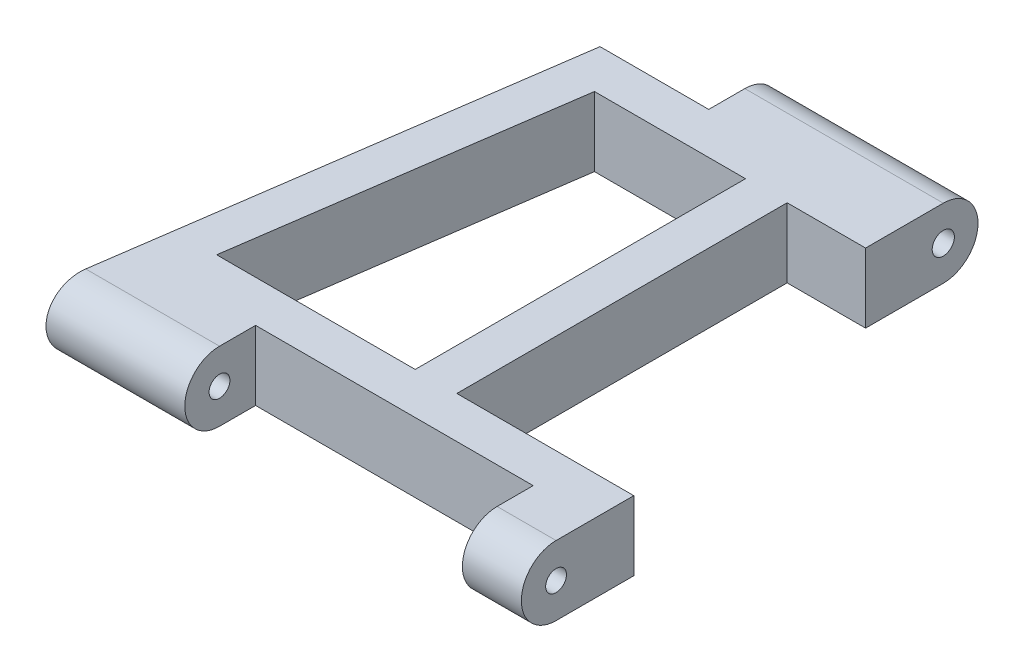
from build123d import *

# Parameters (mm, degrees)
SKETCH_1_W               = 11.3
SKETCH_1_H               = 6
SKETCH_1_W_2             = 3
EXTRUDE_1_DEPTH          = 10
SKETCH_2_R               = 1.6
CUT_EXTRUDE_1_DEPTH      = 28.6
CUT_EXTRUDE_2_DEPTH      = 123.489842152
CUT_EXTRUDE_2_DEPTH_BACK = 123.489842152
SKETCH_3_R               = 1.5


with BuildPart() as part:
    # Sketch 1 → Extrude 1 (new body)
    with BuildSketch(Plane(origin=(0, 0, 0), x_dir=(1, 0, 0), z_dir=(0, 1, 0))):
        Polygon((-99.53752184, 106.319148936), (-113.83752184, 106.319148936), (-113.83752184, 96.119148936), (-102.53752184, 96.119148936), (-99.53752184, 96.119148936), align=None)
        Polygon((-85.23752184, 106.319148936), (-99.53752184, 106.319148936), (-99.53752184, 96.119148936), (-96.53752184, 96.119148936), (-85.23752184, 96.119148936), align=None)
        with Locations((-90.88752184, 93.119148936)):
            Rectangle(SKETCH_1_W, SKETCH_1_H)
        with Locations((-98.03752184, 93.119148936)):
            Rectangle(SKETCH_1_W_2, SKETCH_1_H)
        with Locations((-101.03752184, 93.119148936)):
            Rectangle(SKETCH_1_W_2, SKETCH_1_H)
        Polygon((-99.53752184, 90.119148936), (-102.53752184, 90.119148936), (-102.53752184, 42.519148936), (-99.53752184, 42.519148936), (-99.53752184, 47.377424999), align=None)
        Polygon((-96.53752184, 90.119148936), (-99.53752184, 90.119148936), (-99.53752184, 47.377424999), (-99.53752184, 42.519148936), (-96.53752184, 42.519148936), align=None)
        Polygon((-113.83752184, 96.119148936), (-123.442096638, 96.119148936), (-124.304596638, 90.119148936), (-102.53752184, 90.119148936), (-102.53752184, 96.119148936), align=None)
        Polygon((-123.442096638, 96.119148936), (-128.03752184, 96.119148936), (-128.03752184, 90.119148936), (-124.304596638, 90.119148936), align=None)
        Polygon((-128.03752184, 96.119148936), (-129.50377184, 96.119148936), (-130.36627184, 90.119148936), (-128.03752184, 90.119148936), align=None)
        Polygon((-128.03752184, 90.119148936), (-130.36627184, 90.119148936), (-137.20877184, 42.519148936), (-131.147096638, 42.519148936), (-128.03752184, 64.150973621), align=None)
        Polygon((-124.304596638, 90.119148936), (-128.03752184, 90.119148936), (-128.03752184, 64.150973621), align=None)
        Polygon((-128.03752184, 42.519148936), (-131.147096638, 42.519148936), (-133.475846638, 26.319148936), (-128.03752184, 26.319148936), align=None)
        Polygon((-131.147096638, 42.519148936), (-137.20877184, 42.519148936), (-139.53752184, 26.319148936), (-133.475846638, 26.319148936), align=None)
        Polygon((-102.53752184, 42.519148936), (-128.03752184, 42.519148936), (-128.03752184, 26.319148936), (-119.53752184, 26.319148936), (-119.53752184, 36.519148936), (-99.53752184, 36.519148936), (-99.53752184, 42.519148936), align=None)
        Polygon((-96.53752184, 42.519148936), (-99.53752184, 42.519148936), (-99.53752184, 36.519148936), (-79.53752184, 36.519148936), (-79.53752184, 26.319148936), (-71.03752184, 26.319148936), (-71.03752184, 42.519148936), (-79.03752184, 42.519148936), align=None)
    extrude(amount=EXTRUDE_1_DEPTH)

    # Sketch 2 → Cut-Extrude 1 (cut)
    with BuildSketch(Plane.ZY.offset(113.83752184)):
        with Locations((-101.319148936, 5)):
            Circle(SKETCH_2_R)
        with BuildLine():
            Line((-106.319148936, 10), (-106.319148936, 5))
            ThreePointArc((-106.319148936, 5), (-104.854682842, 8.535533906), (-101.319148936, 10))
            Line((-101.319148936, 10), (-106.319148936, 10))
        make_face()
        with BuildLine():
            Line((-106.319148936, 5), (-106.319148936, 0))
            Line((-106.319148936, 0), (-101.319148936, 0))
            ThreePointArc((-101.319148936, 0), (-104.854682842, 1.464466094), (-106.319148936, 5))
        make_face()
    extrude(amount=-CUT_EXTRUDE_1_DEPTH, mode=Mode.SUBTRACT)

    # Sketch 3 → Cut-Extrude 2 (cut, two sides: drawn at the far end of the back side and taken through both)
    with BuildSketch(Plane.ZY.offset(79.53752184).offset(-CUT_EXTRUDE_2_DEPTH_BACK)):
        with Locations((-31.319148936, 5)):
            Circle(SKETCH_3_R)
        with BuildLine():
            Line((-26.319148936, 10), (-31.319148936, 10))
            ThreePointArc((-31.319148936, 10), (-27.78361503, 8.535533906), (-26.319148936, 5))
            Line((-26.319148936, 5), (-26.319148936, 10))
        make_face()
        with BuildLine():
            ThreePointArc((-26.319148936, 5), (-27.78361503, 1.464466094), (-31.319148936, 0))
            Line((-31.319148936, 0), (-26.319148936, 0))
            Line((-26.319148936, 0), (-26.319148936, 5))
        make_face()
    extrude(amount=CUT_EXTRUDE_2_DEPTH + CUT_EXTRUDE_2_DEPTH_BACK, mode=Mode.SUBTRACT)


solid = part.part
